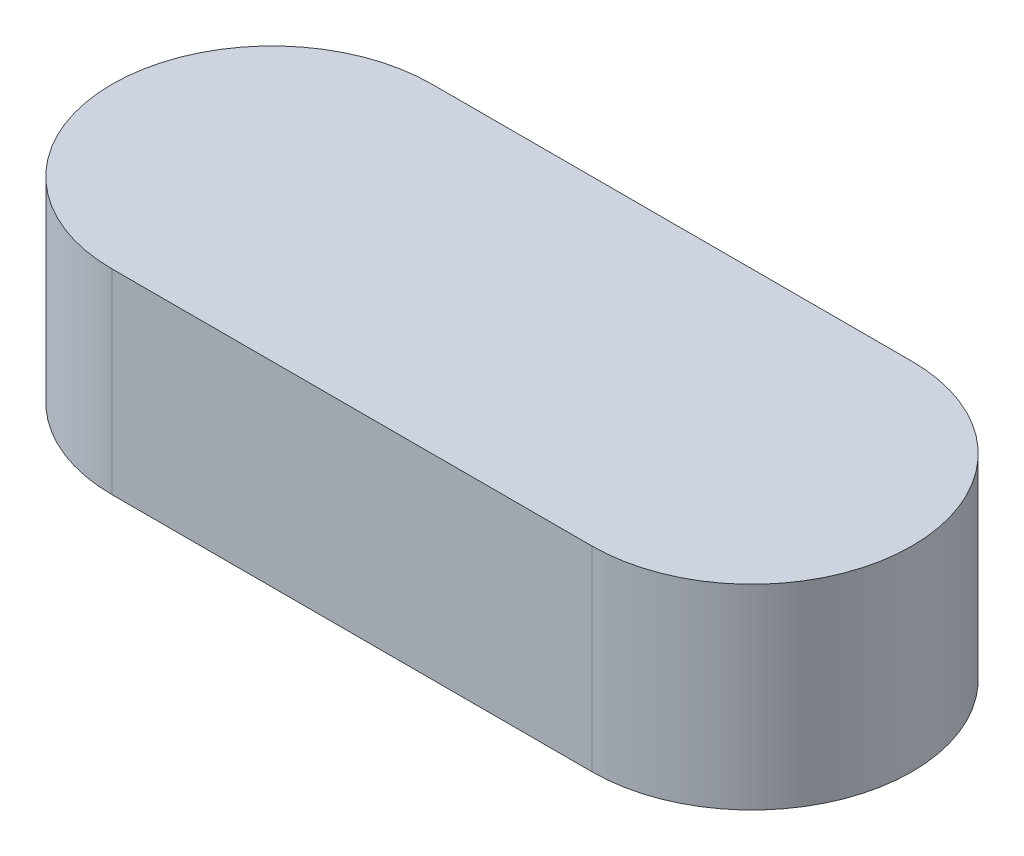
ISO-10303-21;
HEADER;
FILE_DESCRIPTION(('STEP AP214'),'2;1');
FILE_NAME('part.step','',(''),(''),'','','');
FILE_SCHEMA(('AUTOMOTIVE_DESIGN { 1 0 10303 214 1 1 1 1 }'));
ENDSEC;
DATA;
#1=APPLICATION_CONTEXT('core data for automotive mechanical design processes');
#2=APPLICATION_PROTOCOL_DEFINITION('international standard','automotive_design',2000,#1);
#3=PRODUCT_CONTEXT('',#1,'mechanical');
#4=PRODUCT('Part','Part','',(#3));
#5=PRODUCT_RELATED_PRODUCT_CATEGORY('part','',(#4));
#6=PRODUCT_DEFINITION_FORMATION('','',#4);
#7=PRODUCT_DEFINITION_CONTEXT('part definition',#1,'design');
#8=PRODUCT_DEFINITION('design','',#6,#7);
#9=PRODUCT_DEFINITION_SHAPE('','',#8);
#10=(LENGTH_UNIT() NAMED_UNIT(*) SI_UNIT(.MILLI.,.METRE.));
#11=(NAMED_UNIT(*) PLANE_ANGLE_UNIT() SI_UNIT($,.RADIAN.));
#12=(NAMED_UNIT(*) SI_UNIT($,.STERADIAN.) SOLID_ANGLE_UNIT());
#13=UNCERTAINTY_MEASURE_WITH_UNIT(LENGTH_MEASURE(1.E-05),#10,'distance_accuracy_value','');
#14=(GEOMETRIC_REPRESENTATION_CONTEXT(3) GLOBAL_UNCERTAINTY_ASSIGNED_CONTEXT((#13)) GLOBAL_UNIT_ASSIGNED_CONTEXT((#10,
#11,#12)) REPRESENTATION_CONTEXT('',''));
#15=CARTESIAN_POINT('',(0.,0.,0.));
#16=DIRECTION('',(0.,0.,1.));
#17=DIRECTION('',(1.,0.,0.));
#18=AXIS2_PLACEMENT_3D('',#15,#16,#17);
#19=CARTESIAN_POINT('',(27.,11.,0.));
#20=DIRECTION('',(0.,-1.,0.));
#21=DIRECTION('',(0.,0.,-1.));
#22=AXIS2_PLACEMENT_3D('',#19,#20,#21);
#23=CYLINDRICAL_SURFACE('',#22,9.00000000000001);
#24=CARTESIAN_POINT('',(27.,0.,0.));
#25=DIRECTION('',(0.,1.,0.));
#26=DIRECTION('',(0.,0.,1.));
#27=AXIS2_PLACEMENT_3D('',#24,#25,#26);
#28=CIRCLE('',#27,9.00000000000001);
#29=CARTESIAN_POINT('',(27.,0.,9.00000000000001));
#30=VERTEX_POINT('',#29);
#31=CARTESIAN_POINT('',(27.,0.,-9.00000000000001));
#32=VERTEX_POINT('',#31);
#33=EDGE_CURVE('E95',#30,#32,#28,.T.);
#34=ORIENTED_EDGE('',*,*,#33,.T.);
#35=DIRECTION('',(0.,-1.,0.));
#36=VECTOR('',#35,1.);
#37=CARTESIAN_POINT('',(27.,11.,-9.00000000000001));
#38=LINE('',#37,#36);
#39=CARTESIAN_POINT('',(27.,11.,-9.00000000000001));
#40=VERTEX_POINT('',#39);
#41=EDGE_CURVE('E11',#40,#32,#38,.T.);
#42=ORIENTED_EDGE('',*,*,#41,.F.);
#43=CARTESIAN_POINT('',(27.,11.,0.));
#44=DIRECTION('',(0.,1.,0.));
#45=DIRECTION('',(0.,0.,1.));
#46=AXIS2_PLACEMENT_3D('',#43,#44,#45);
#47=CIRCLE('',#46,9.00000000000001);
#48=CARTESIAN_POINT('',(27.,11.,9.00000000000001));
#49=VERTEX_POINT('',#48);
#50=EDGE_CURVE('E83',#49,#40,#47,.T.);
#51=ORIENTED_EDGE('',*,*,#50,.F.);
#52=DIRECTION('',(0.,-1.,0.));
#53=VECTOR('',#52,1.);
#54=CARTESIAN_POINT('',(27.,11.,9.00000000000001));
#55=LINE('',#54,#53);
#56=EDGE_CURVE('E91',#49,#30,#55,.T.);
#57=ORIENTED_EDGE('',*,*,#56,.T.);
#58=EDGE_LOOP('',(#34,#42,#51,#57));
#59=FACE_BOUND('',#58,.T.);
#60=ADVANCED_FACE('F32',(#59),#23,.T.);
#61=CARTESIAN_POINT('',(27.,11.,-9.00000000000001));
#62=DIRECTION('',(0.,0.,1.));
#63=DIRECTION('',(1.,0.,0.));
#64=AXIS2_PLACEMENT_3D('',#61,#62,#63);
#65=PLANE('',#64);
#66=DIRECTION('',(-1.,0.,0.));
#67=VECTOR('',#66,1.);
#68=CARTESIAN_POINT('',(27.,0.,-9.00000000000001));
#69=LINE('',#68,#67);
#70=CARTESIAN_POINT('',(0.,0.,-9.00000000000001));
#71=VERTEX_POINT('',#70);
#72=EDGE_CURVE('E87',#32,#71,#69,.T.);
#73=ORIENTED_EDGE('',*,*,#72,.T.);
#74=DIRECTION('',(0.,-1.,0.));
#75=VECTOR('',#74,1.);
#76=CARTESIAN_POINT('',(0.,11.,-9.00000000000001));
#77=LINE('',#76,#75);
#78=CARTESIAN_POINT('',(0.,11.,-9.00000000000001));
#79=VERTEX_POINT('',#78);
#80=EDGE_CURVE('E40',#79,#71,#77,.T.);
#81=ORIENTED_EDGE('',*,*,#80,.F.);
#82=DIRECTION('',(-1.,0.,0.));
#83=VECTOR('',#82,1.);
#84=CARTESIAN_POINT('',(27.,11.,-9.00000000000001));
#85=LINE('',#84,#83);
#86=EDGE_CURVE('E78',#40,#79,#85,.T.);
#87=ORIENTED_EDGE('',*,*,#86,.F.);
#88=ORIENTED_EDGE('',*,*,#41,.T.);
#89=EDGE_LOOP('',(#73,#81,#87,#88));
#90=FACE_BOUND('',#89,.T.);
#91=ADVANCED_FACE('F86',(#90),#65,.F.);
#92=CARTESIAN_POINT('',(0.,11.,0.));
#93=DIRECTION('',(0.,-1.,0.));
#94=DIRECTION('',(0.,0.,-1.));
#95=AXIS2_PLACEMENT_3D('',#92,#93,#94);
#96=CYLINDRICAL_SURFACE('',#95,9.00000000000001);
#97=CARTESIAN_POINT('',(0.,0.,0.));
#98=DIRECTION('',(0.,1.,0.));
#99=DIRECTION('',(0.,0.,1.));
#100=AXIS2_PLACEMENT_3D('',#97,#98,#99);
#101=CIRCLE('',#100,9.00000000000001);
#102=CARTESIAN_POINT('',(0.,0.,9.00000000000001));
#103=VERTEX_POINT('',#102);
#104=EDGE_CURVE('E65',#71,#103,#101,.T.);
#105=ORIENTED_EDGE('',*,*,#104,.T.);
#106=DIRECTION('',(0.,-1.,0.));
#107=VECTOR('',#106,1.);
#108=CARTESIAN_POINT('',(0.,11.,9.00000000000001));
#109=LINE('',#108,#107);
#110=CARTESIAN_POINT('',(0.,11.,9.00000000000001));
#111=VERTEX_POINT('',#110);
#112=EDGE_CURVE('E88',#111,#103,#109,.T.);
#113=ORIENTED_EDGE('',*,*,#112,.F.);
#114=CARTESIAN_POINT('',(0.,11.,0.));
#115=DIRECTION('',(0.,1.,0.));
#116=DIRECTION('',(0.,0.,1.));
#117=AXIS2_PLACEMENT_3D('',#114,#115,#116);
#118=CIRCLE('',#117,9.00000000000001);
#119=EDGE_CURVE('E81',#79,#111,#118,.T.);
#120=ORIENTED_EDGE('',*,*,#119,.F.);
#121=ORIENTED_EDGE('',*,*,#80,.T.);
#122=EDGE_LOOP('',(#105,#113,#120,#121));
#123=FACE_BOUND('',#122,.T.);
#124=ADVANCED_FACE('F89',(#123),#96,.T.);
#125=CARTESIAN_POINT('',(0.,11.,9.00000000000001));
#126=DIRECTION('',(0.,0.,-1.));
#127=DIRECTION('',(-1.,0.,0.));
#128=AXIS2_PLACEMENT_3D('',#125,#126,#127);
#129=PLANE('',#128);
#130=DIRECTION('',(1.,0.,0.));
#131=VECTOR('',#130,1.);
#132=CARTESIAN_POINT('',(0.,0.,9.00000000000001));
#133=LINE('',#132,#131);
#134=EDGE_CURVE('E71',#103,#30,#133,.T.);
#135=ORIENTED_EDGE('',*,*,#134,.T.);
#136=ORIENTED_EDGE('',*,*,#56,.F.);
#137=DIRECTION('',(1.,0.,0.));
#138=VECTOR('',#137,1.);
#139=CARTESIAN_POINT('',(0.,11.,9.00000000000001));
#140=LINE('',#139,#138);
#141=EDGE_CURVE('E48',#111,#49,#140,.T.);
#142=ORIENTED_EDGE('',*,*,#141,.F.);
#143=ORIENTED_EDGE('',*,*,#112,.T.);
#144=EDGE_LOOP('',(#135,#136,#142,#143));
#145=FACE_BOUND('',#144,.T.);
#146=ADVANCED_FACE('F102',(#145),#129,.F.);
#147=CARTESIAN_POINT('',(27.,11.,0.));
#148=DIRECTION('',(0.,1.,0.));
#149=DIRECTION('',(0.,0.,1.));
#150=AXIS2_PLACEMENT_3D('',#147,#148,#149);
#151=PLANE('',#150);
#152=ORIENTED_EDGE('',*,*,#50,.T.);
#153=ORIENTED_EDGE('',*,*,#86,.T.);
#154=ORIENTED_EDGE('',*,*,#119,.T.);
#155=ORIENTED_EDGE('',*,*,#141,.T.);
#156=EDGE_LOOP('',(#152,#153,#154,#155));
#157=FACE_BOUND('',#156,.T.);
#158=ADVANCED_FACE('F79',(#157),#151,.T.);
#159=CARTESIAN_POINT('',(27.,0.,0.));
#160=DIRECTION('',(0.,1.,0.));
#161=DIRECTION('',(0.,0.,1.));
#162=AXIS2_PLACEMENT_3D('',#159,#160,#161);
#163=PLANE('',#162);
#164=ORIENTED_EDGE('',*,*,#33,.F.);
#165=ORIENTED_EDGE('',*,*,#134,.F.);
#166=ORIENTED_EDGE('',*,*,#104,.F.);
#167=ORIENTED_EDGE('',*,*,#72,.F.);
#168=EDGE_LOOP('',(#164,#165,#166,#167));
#169=FACE_BOUND('',#168,.T.);
#170=ADVANCED_FACE('F105',(#169),#163,.F.);
#171=CLOSED_SHELL('',(#60,#91,#124,#146,#158,#170));
#172=MANIFOLD_SOLID_BREP('B2',#171);
#173=ADVANCED_BREP_SHAPE_REPRESENTATION('',(#18,#172),#14);
#174=SHAPE_DEFINITION_REPRESENTATION(#9,#173);
ENDSEC;
END-ISO-10303-21;
